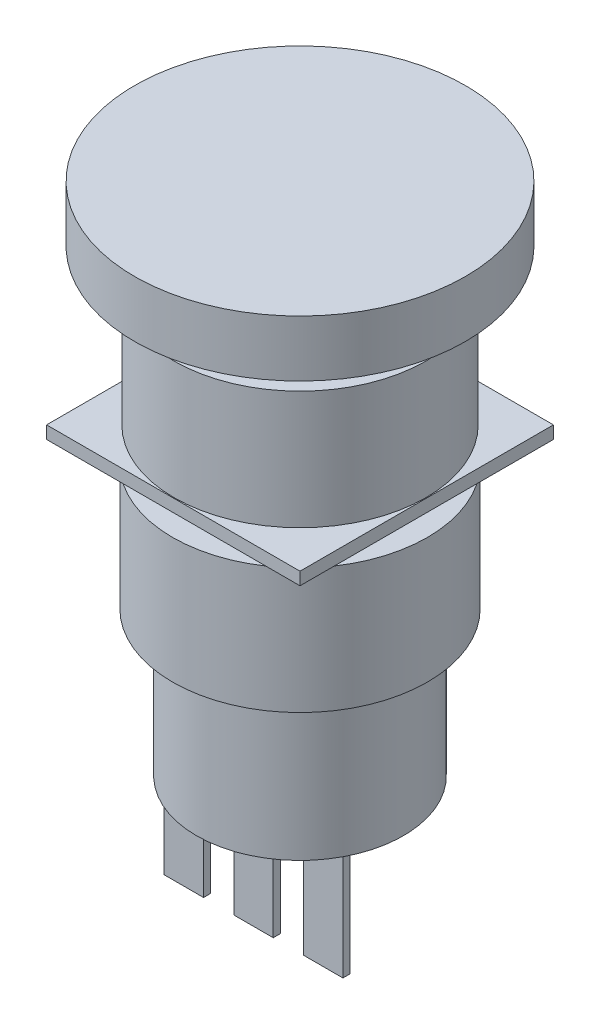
from build123d import *

# Parameters (mm, degrees)
ESBO_O2_W                = 18
ESBO_O2_H                = 18
RESSALTO_EXTRUS_O1_DEPTH = 0.9
RESSALTO_EXTRUS_O2_START = 2.8
ESBO_O4_W                = 2.8
ESBO_O4_H                = 7.6
RESSALTO_EXTRUS_O2_DEPTH = 0.5
ESBO_O5_W                = 1.6
ESBO_O5_H                = 8.9


with BuildPart() as part:
    # Esbo_o1 → Revolu_o1 (revolve)
    with BuildSketch(Plane.XY, mode=Mode.PRIVATE) as revolu_o1_sk:
        Polygon((0, 0), (-8.95, 0), (-8.95, -8.4), (-7.35, -8.4), (-7.35, -30), (0, -30), align=None)
    revolve(revolu_o1_sk.sketch.rotate(Axis((0, 0, 0), (0, -1, 0)), 270), axis=Axis((0, 0, 0), (0, -1, 0)))

    # Esbo_o2 → Ressalto-extrus_o1 (add)
    with BuildSketch(Plane.XZ.offset(8.4)):
        Rectangle(ESBO_O2_W, ESBO_O2_H)
    extrude(amount=RESSALTO_EXTRUS_O1_DEPTH)

    # Esbo_o3 → Revolu_o2 (revolve)
    with BuildSketch(Plane.XY, mode=Mode.PRIVATE) as revolu_o2_sk:
        Polygon((-11.75, 6.6), (-11.75, 2.6), (-7.8, 2.6), (-7.8, -3.8), (0, -3.8), (0, 6.6), align=None)
    revolve(revolu_o2_sk.sketch.rotate(Axis((0, -3.8, 0), (0, 1, 0)), 180), axis=Axis((0, -3.8, 0), (0, 1, 0)))

    # Esbo_o4 → Ressalto-extrus_o2 (add)
    with BuildSketch(Plane.XY.offset(RESSALTO_EXTRUS_O2_START)):
        with Locations((-4.95, -33.8)):
            Rectangle(ESBO_O4_W, ESBO_O4_H)
        with Locations((0, -33.8)):
            Rectangle(ESBO_O4_W, ESBO_O4_H)
        with Locations((4.95, -33.8)):
            Rectangle(ESBO_O4_W, ESBO_O4_H)
    extrude(amount=RESSALTO_EXTRUS_O2_DEPTH)


with BuildPart() as body_2:
    # Esbo_o5 → Revolu_o3 (revolve)
    with BuildSketch(Plane.XY, mode=Mode.PRIVATE) as revolu_o3_sk:
        with Locations((-8.25, -15.25)):
            Rectangle(ESBO_O5_W, ESBO_O5_H)
    revolve(revolu_o3_sk.sketch.rotate(Axis((0, 0, 0), (0, -1, 0)), 270), axis=Axis((0, 0, 0), (0, -1, 0)))


solid = Compound([part.part, body_2.part])
